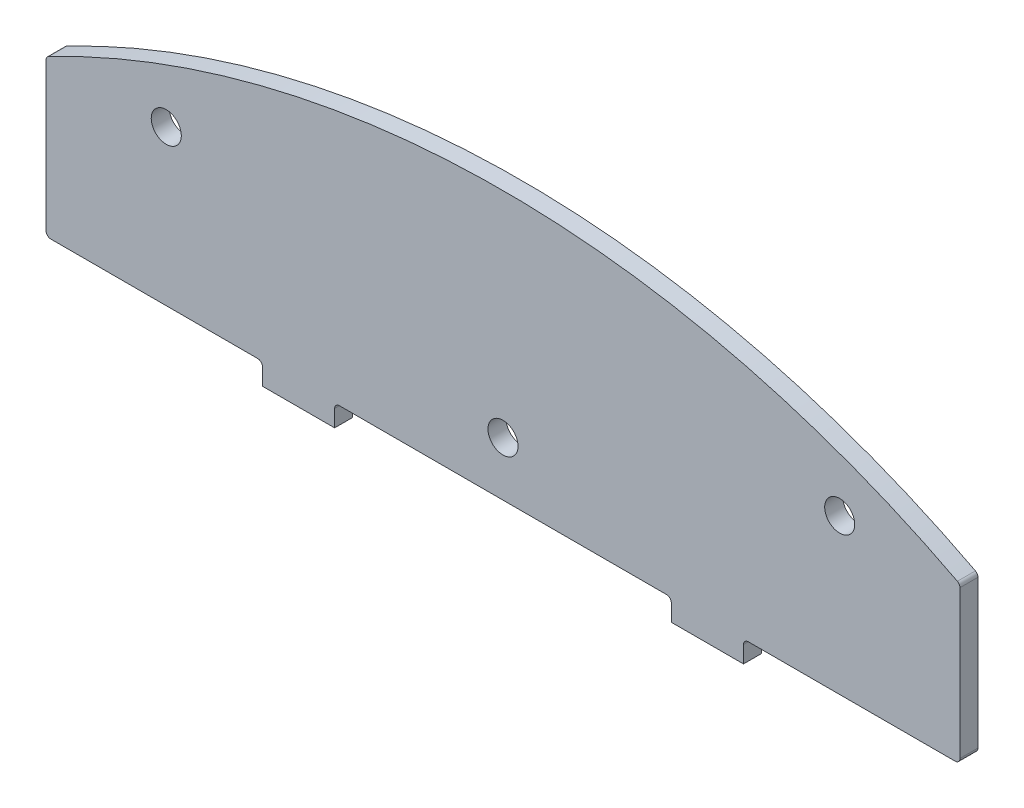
from build123d import *

# Parameters (mm, degrees)
EXTRUDE1_DEPTH                 = 4.7625
F_5_16_0_3125_DIAMETER_HOLE1_D = 7.9375
FILLET1_R                      = 1.27
FILLET3_R                      = 1.27


with BuildPart() as part:
    # Sketch1 → Extrude1 (new body)
    with BuildSketch(Plane.XY):
        with BuildLine():
            Line((-120.65, 229.990127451), (-120.65, 188.9125))
            Line((-120.65, 188.9125), (-63.5, 188.9125))
            Line((-63.5, 188.9125), (-63.5, 183.204247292))
            Line((-63.5, 183.204247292), (-44.45, 183.204247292))
            Line((-44.45, 183.204247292), (-44.45, 188.9125))
            Line((-44.45, 188.9125), (44.45, 188.9125))
            Line((44.45, 188.9125), (44.45, 183.204247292))
            Line((44.45, 183.204247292), (63.5, 183.204247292))
            Line((63.5, 183.204247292), (63.5, 188.9125))
            Line((63.5, 188.9125), (120.65, 188.9125))
            Line((120.65, 188.9125), (120.65, 229.990127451))
            ThreePointArc((120.65, 229.990127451), (0, 259.715), (-120.65, 229.990127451))
        make_face()
    extrude(amount=EXTRUDE1_DEPTH)

    # 5_16 _0.3125_ Diameter Hole1 (through all)
    with Locations(Plane(origin=(0, 0, 0), x_dir=(-1, 0, 0), z_dir=(0, 0, -1))):
        with Locations((0, 203.2), (-88.899526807, 229.782459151), (88.90047319, 229.783501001)):
            Hole(F_5_16_0_3125_DIAMETER_HOLE1_D / 2)

    # Fillet1
    fillet1_edges = [part.edges().sort_by_distance(p)[0] for p in [
        (-120.65, 188.9125, 2.38125),
        (-120.65, 229.990127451, 2.38125),
        (120.65, 229.990127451, 2.38125),
        (120.65, 188.9125, 2.38125),
    ]]
    fillet(fillet1_edges, radius=FILLET1_R)

    # Fillet3
    fillet3_edges = [part.edges().sort_by_distance(p)[0] for p in [
        (-63.5, 188.9125, 2.38125),
        (63.5, 188.9125, 2.38125),
        (44.45, 188.9125, 2.38125),
        (-44.45, 188.9125, 2.38125),
    ]]
    fillet(fillet3_edges, radius=FILLET3_R)


solid = part.part
